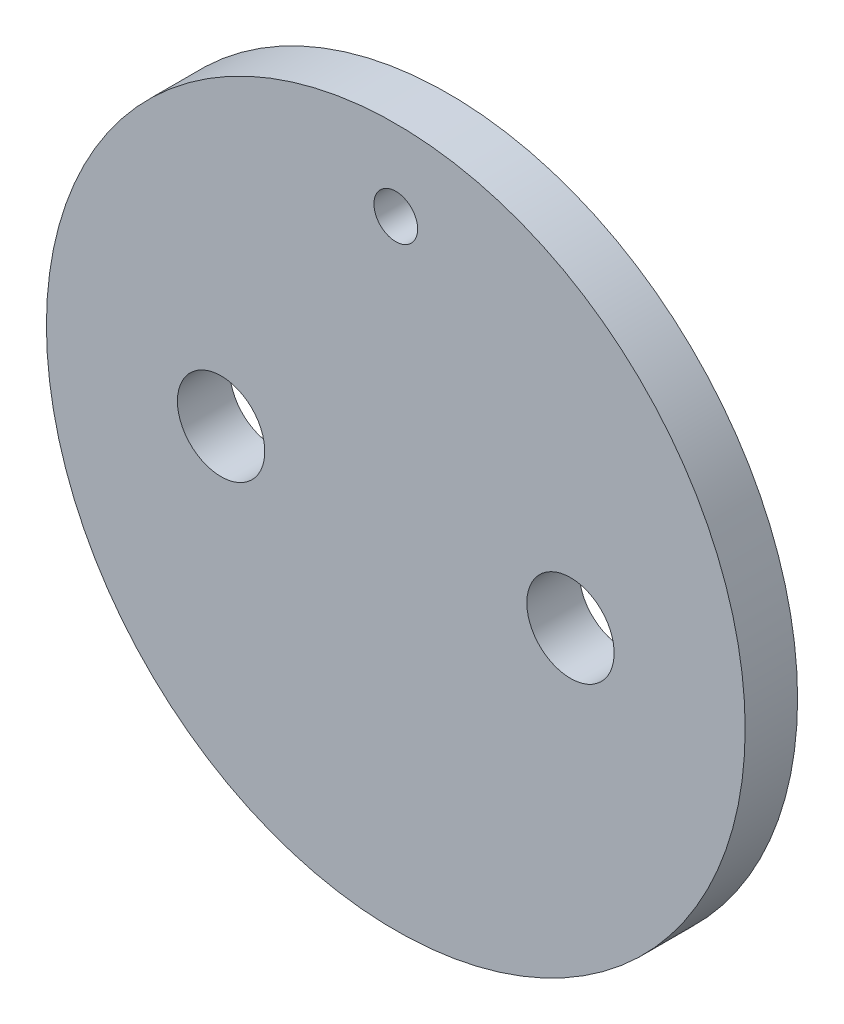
from build123d import *

# Parameters (mm, degrees)
SKETCH1_R          = 25.4
EXTRUDE1_DEPTH     = 3.81
SKETCH2_R          = 1.5875
SKETCH2_R_2        = 3.175
CUT_EXTRUDE1_DEPTH = 37.122515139


with BuildPart() as part:
    # Sketch1 → Extrude1 (new body)
    with BuildSketch(Plane.XY):
        with Locations(Location((0, 0, 0), (0, 0, 180))):
            Circle(SKETCH1_R)
    extrude(amount=EXTRUDE1_DEPTH)

    # Sketch2 → Cut-Extrude1 (cut, through all)
    with BuildSketch(Plane.XY):
        with Locations(Location((0, 19.558, 0), (0, 0, 180))):
            Circle(SKETCH2_R)
        with Locations(Location((12.7, 0, 0), (0, 0, 180))):
            Circle(SKETCH2_R_2)
        with Locations(Location((-12.7, 0, 0), (0, 0, 180))):
            Circle(SKETCH2_R_2)
    extrude(amount=CUT_EXTRUDE1_DEPTH, mode=Mode.SUBTRACT)


solid = part.part
